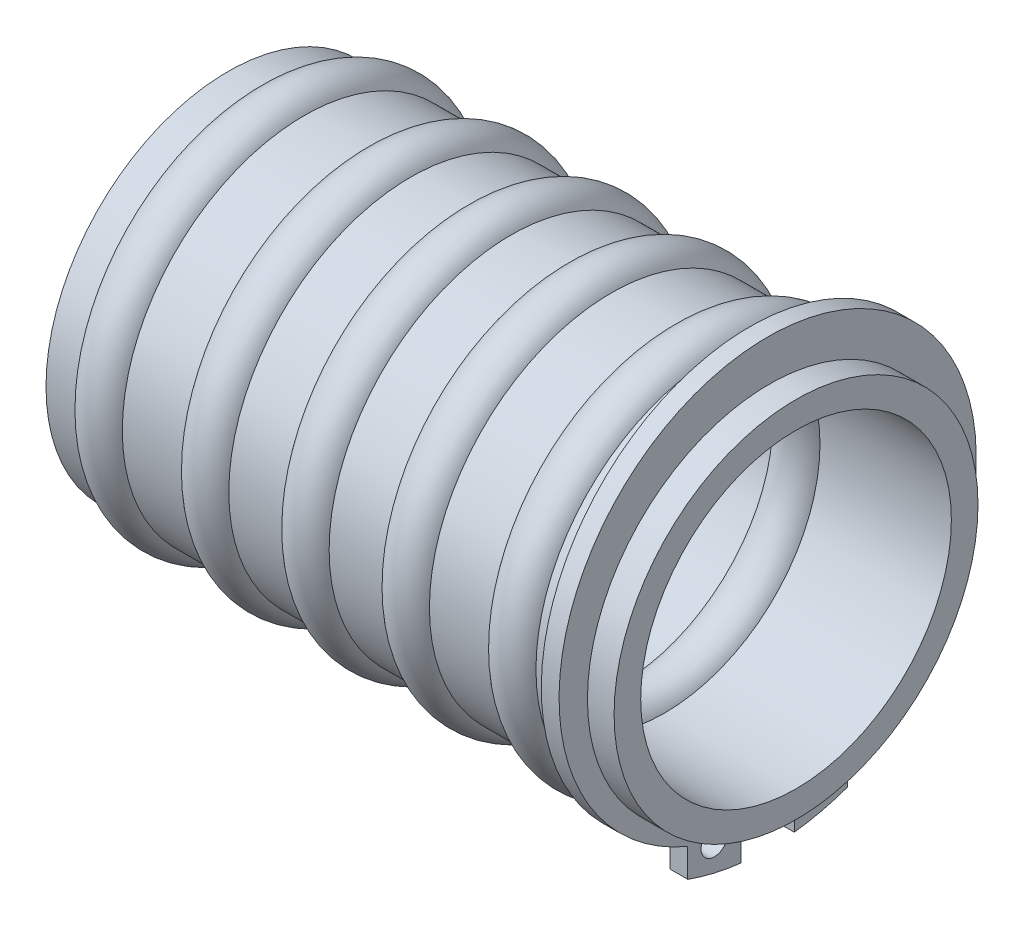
ISO-10303-21;
HEADER;
FILE_DESCRIPTION(('STEP AP214'),'2;1');
FILE_NAME('part.step','',(''),(''),'','','');
FILE_SCHEMA(('AUTOMOTIVE_DESIGN { 1 0 10303 214 1 1 1 1 }'));
ENDSEC;
DATA;
#1=APPLICATION_CONTEXT('core data for automotive mechanical design processes');
#2=APPLICATION_PROTOCOL_DEFINITION('international standard','automotive_design',2000,#1);
#3=PRODUCT_CONTEXT('',#1,'mechanical');
#4=PRODUCT('Part','Part','',(#3));
#5=PRODUCT_RELATED_PRODUCT_CATEGORY('part','',(#4));
#6=PRODUCT_DEFINITION_FORMATION('','',#4);
#7=PRODUCT_DEFINITION_CONTEXT('part definition',#1,'design');
#8=PRODUCT_DEFINITION('design','',#6,#7);
#9=PRODUCT_DEFINITION_SHAPE('','',#8);
#10=(LENGTH_UNIT() NAMED_UNIT(*) SI_UNIT(.MILLI.,.METRE.));
#11=(NAMED_UNIT(*) PLANE_ANGLE_UNIT() SI_UNIT($,.RADIAN.));
#12=(NAMED_UNIT(*) SI_UNIT($,.STERADIAN.) SOLID_ANGLE_UNIT());
#13=UNCERTAINTY_MEASURE_WITH_UNIT(LENGTH_MEASURE(1.E-05),#10,'distance_accuracy_value','');
#14=(GEOMETRIC_REPRESENTATION_CONTEXT(3) GLOBAL_UNCERTAINTY_ASSIGNED_CONTEXT((#13)) GLOBAL_UNIT_ASSIGNED_CONTEXT((#10,
#11,#12)) REPRESENTATION_CONTEXT('',''));
#15=CARTESIAN_POINT('',(0.,0.,0.));
#16=DIRECTION('',(0.,0.,1.));
#17=DIRECTION('',(1.,0.,0.));
#18=AXIS2_PLACEMENT_3D('',#15,#16,#17);
#19=CARTESIAN_POINT('',(32.,0.,0.));
#20=DIRECTION('',(-1.,0.,0.));
#21=DIRECTION('',(0.,0.,1.));
#22=AXIS2_PLACEMENT_3D('',#19,#20,#21);
#23=CYLINDRICAL_SURFACE('',#22,9.5);
#24=CARTESIAN_POINT('',(30.5,0.,0.));
#25=DIRECTION('',(-1.,0.,0.));
#26=DIRECTION('',(0.,0.,1.));
#27=AXIS2_PLACEMENT_3D('',#24,#25,#26);
#28=CIRCLE('',#27,9.5);
#29=CARTESIAN_POINT('',(30.5,0.,9.5));
#30=VERTEX_POINT('',#29);
#31=EDGE_CURVE('E203',#30,#30,#28,.T.);
#32=ORIENTED_EDGE('',*,*,#31,.T.);
#33=EDGE_LOOP('',(#32));
#34=FACE_BOUND('',#33,.T.);
#35=CARTESIAN_POINT('',(29.3,0.,0.));
#36=DIRECTION('',(-1.,0.,0.));
#37=DIRECTION('',(0.,0.,1.));
#38=AXIS2_PLACEMENT_3D('',#35,#36,#37);
#39=CIRCLE('',#38,9.5);
#40=CARTESIAN_POINT('',(29.3,0.,9.5));
#41=VERTEX_POINT('',#40);
#42=EDGE_CURVE('E200',#41,#41,#39,.T.);
#43=ORIENTED_EDGE('',*,*,#42,.F.);
#44=EDGE_LOOP('',(#43));
#45=FACE_BOUND('',#44,.T.);
#46=DIRECTION('',(-1.,0.,0.));
#47=VECTOR('',#46,1.);
#48=CARTESIAN_POINT('',(32.,-9.38083151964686,1.5));
#49=LINE('',#48,#47);
#50=CARTESIAN_POINT('',(29.4,-9.38083151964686,1.5));
#51=VERTEX_POINT('',#50);
#52=CARTESIAN_POINT('',(30.4,-9.38083151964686,1.5));
#53=VERTEX_POINT('',#52);
#54=EDGE_CURVE('E11',#51,#53,#49,.F.);
#55=ORIENTED_EDGE('',*,*,#54,.F.);
#56=CARTESIAN_POINT('',(29.4,0.,0.));
#57=DIRECTION('',(1.,0.,0.));
#58=DIRECTION('',(0.,0.,-1.));
#59=AXIS2_PLACEMENT_3D('',#56,#57,#58);
#60=CIRCLE('',#59,9.5);
#61=CARTESIAN_POINT('',(29.4,-9.38083151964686,-1.5));
#62=VERTEX_POINT('',#61);
#63=EDGE_CURVE('E237',#62,#51,#60,.T.);
#64=ORIENTED_EDGE('',*,*,#63,.F.);
#65=DIRECTION('',(-1.,0.,0.));
#66=VECTOR('',#65,1.);
#67=CARTESIAN_POINT('',(32.,-9.38083151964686,-1.5));
#68=LINE('',#67,#66);
#69=CARTESIAN_POINT('',(30.4,-9.38083151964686,-1.5));
#70=VERTEX_POINT('',#69);
#71=EDGE_CURVE('E170',#70,#62,#68,.T.);
#72=ORIENTED_EDGE('',*,*,#71,.F.);
#73=CARTESIAN_POINT('',(30.4,0.,0.));
#74=DIRECTION('',(1.,0.,0.));
#75=DIRECTION('',(0.,0.,-1.));
#76=AXIS2_PLACEMENT_3D('',#73,#74,#75);
#77=CIRCLE('',#76,9.5);
#78=EDGE_CURVE('E42',#70,#53,#77,.T.);
#79=ORIENTED_EDGE('',*,*,#78,.T.);
#80=EDGE_LOOP('',(#55,#64,#72,#79));
#81=FACE_BOUND('',#80,.T.);
#82=ADVANCED_FACE('F34',(#34,#45,#81),#23,.T.);
#83=CARTESIAN_POINT('',(32.,0.,0.));
#84=DIRECTION('',(-1.,0.,0.));
#85=DIRECTION('',(0.,0.,1.));
#86=AXIS2_PLACEMENT_3D('',#83,#84,#85);
#87=CYLINDRICAL_SURFACE('',#86,8.75);
#88=CARTESIAN_POINT('',(22.000961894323,0.,0.));
#89=DIRECTION('',(-1.,0.,0.));
#90=DIRECTION('',(0.,0.,1.));
#91=AXIS2_PLACEMENT_3D('',#88,#89,#90);
#92=CIRCLE('',#91,8.75);
#93=CARTESIAN_POINT('',(22.000961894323,0.,8.75));
#94=VERTEX_POINT('',#93);
#95=EDGE_CURVE('E218',#94,#94,#92,.T.);
#96=ORIENTED_EDGE('',*,*,#95,.F.);
#97=EDGE_LOOP('',(#96));
#98=FACE_BOUND('',#97,.T.);
#99=CARTESIAN_POINT('',(15.9490381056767,0.,0.));
#100=DIRECTION('',(-1.,0.,0.));
#101=DIRECTION('',(0.,0.,1.));
#102=AXIS2_PLACEMENT_3D('',#99,#100,#101);
#103=CIRCLE('',#102,8.75);
#104=CARTESIAN_POINT('',(15.9490381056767,0.,8.75));
#105=VERTEX_POINT('',#104);
#106=EDGE_CURVE('E163',#105,#105,#103,.F.);
#107=ORIENTED_EDGE('',*,*,#106,.F.);
#108=EDGE_LOOP('',(#107));
#109=FACE_BOUND('',#108,.T.);
#110=ADVANCED_FACE('F260',(#98,#109),#87,.F.);
#111=CARTESIAN_POINT('',(32.,0.,0.));
#112=DIRECTION('',(-1.,0.,0.));
#113=DIRECTION('',(0.,0.,1.));
#114=AXIS2_PLACEMENT_3D('',#111,#112,#113);
#115=CYLINDRICAL_SURFACE('',#114,10.25);
#116=CARTESIAN_POINT('',(19.000961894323,0.,0.));
#117=DIRECTION('',(-1.,0.,0.));
#118=DIRECTION('',(0.,0.,1.));
#119=AXIS2_PLACEMENT_3D('',#116,#117,#118);
#120=CIRCLE('',#119,10.25);
#121=CARTESIAN_POINT('',(19.000961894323,0.,10.25));
#122=VERTEX_POINT('',#121);
#123=EDGE_CURVE('E185',#122,#122,#120,.T.);
#124=ORIENTED_EDGE('',*,*,#123,.T.);
#125=EDGE_LOOP('',(#124));
#126=FACE_BOUND('',#125,.T.);
#127=CARTESIAN_POINT('',(15.9490381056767,0.,0.));
#128=DIRECTION('',(-1.,0.,0.));
#129=DIRECTION('',(0.,0.,1.));
#130=AXIS2_PLACEMENT_3D('',#127,#128,#129);
#131=CIRCLE('',#130,10.25);
#132=CARTESIAN_POINT('',(15.9490381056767,0.,10.25));
#133=VERTEX_POINT('',#132);
#134=EDGE_CURVE('E230',#133,#133,#131,.T.);
#135=ORIENTED_EDGE('',*,*,#134,.F.);
#136=EDGE_LOOP('',(#135));
#137=FACE_BOUND('',#136,.T.);
#138=ADVANCED_FACE('F266',(#126,#137),#115,.T.);
#139=CARTESIAN_POINT('',(23.3,0.,0.));
#140=DIRECTION('',(-1.,0.,0.));
#141=DIRECTION('',(0.,0.,1.));
#142=AXIS2_PLACEMENT_3D('',#139,#140,#141);
#143=TOROIDAL_SURFACE('',#142,9.50000000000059,1.50000000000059);
#144=CARTESIAN_POINT('',(24.599038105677,0.,0.));
#145=DIRECTION('',(-1.,0.,0.));
#146=DIRECTION('',(0.,0.,1.));
#147=AXIS2_PLACEMENT_3D('',#144,#145,#146);
#148=CIRCLE('',#147,8.75);
#149=CARTESIAN_POINT('',(24.599038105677,0.,8.75));
#150=VERTEX_POINT('',#149);
#151=EDGE_CURVE('E215',#150,#150,#148,.T.);
#152=ORIENTED_EDGE('',*,*,#151,.F.);
#153=EDGE_LOOP('',(#152));
#154=FACE_BOUND('',#153,.T.);
#155=ORIENTED_EDGE('',*,*,#95,.T.);
#156=EDGE_LOOP('',(#155));
#157=FACE_BOUND('',#156,.T.);
#158=ADVANCED_FACE('F290',(#154,#157),#143,.T.);
#159=CARTESIAN_POINT('',(32.,0.,0.));
#160=DIRECTION('',(-1.,0.,0.));
#161=DIRECTION('',(0.,0.,1.));
#162=AXIS2_PLACEMENT_3D('',#159,#160,#161);
#163=CYLINDRICAL_SURFACE('',#162,8.75);
#164=CARTESIAN_POINT('',(32.,0.,0.));
#165=DIRECTION('',(-1.,0.,0.));
#166=DIRECTION('',(0.,0.,1.));
#167=AXIS2_PLACEMENT_3D('',#164,#165,#166);
#168=CIRCLE('',#167,8.75);
#169=CARTESIAN_POINT('',(32.,0.,8.75));
#170=VERTEX_POINT('',#169);
#171=EDGE_CURVE('E212',#170,#170,#168,.T.);
#172=ORIENTED_EDGE('',*,*,#171,.F.);
#173=EDGE_LOOP('',(#172));
#174=FACE_BOUND('',#173,.T.);
#175=ORIENTED_EDGE('',*,*,#151,.T.);
#176=EDGE_LOOP('',(#175));
#177=FACE_BOUND('',#176,.T.);
#178=ADVANCED_FACE('F286',(#174,#177),#163,.F.);
#179=CARTESIAN_POINT('',(32.,8.75,0.));
#180=DIRECTION('',(-1.,0.,0.));
#181=DIRECTION('',(0.,0.,1.));
#182=AXIS2_PLACEMENT_3D('',#179,#180,#181);
#183=PLANE('',#182);
#184=CARTESIAN_POINT('',(32.,0.,0.));
#185=DIRECTION('',(-1.,0.,0.));
#186=DIRECTION('',(0.,0.,1.));
#187=AXIS2_PLACEMENT_3D('',#184,#185,#186);
#188=CIRCLE('',#187,10.25);
#189=CARTESIAN_POINT('',(32.,0.,10.25));
#190=VERTEX_POINT('',#189);
#191=EDGE_CURVE('E209',#190,#190,#188,.T.);
#192=ORIENTED_EDGE('',*,*,#191,.F.);
#193=EDGE_LOOP('',(#192));
#194=FACE_BOUND('',#193,.T.);
#195=ORIENTED_EDGE('',*,*,#171,.T.);
#196=EDGE_LOOP('',(#195));
#197=FACE_BOUND('',#196,.T.);
#198=ADVANCED_FACE('F282',(#194,#197),#183,.F.);
#199=CARTESIAN_POINT('',(32.,0.,0.));
#200=DIRECTION('',(-1.,0.,0.));
#201=DIRECTION('',(0.,0.,1.));
#202=AXIS2_PLACEMENT_3D('',#199,#200,#201);
#203=CYLINDRICAL_SURFACE('',#202,10.25);
#204=CARTESIAN_POINT('',(30.5,0.,0.));
#205=DIRECTION('',(-1.,0.,0.));
#206=DIRECTION('',(0.,0.,1.));
#207=AXIS2_PLACEMENT_3D('',#204,#205,#206);
#208=CIRCLE('',#207,10.25);
#209=CARTESIAN_POINT('',(30.5,0.,10.25));
#210=VERTEX_POINT('',#209);
#211=EDGE_CURVE('E206',#210,#210,#208,.T.);
#212=ORIENTED_EDGE('',*,*,#211,.F.);
#213=EDGE_LOOP('',(#212));
#214=FACE_BOUND('',#213,.T.);
#215=ORIENTED_EDGE('',*,*,#191,.T.);
#216=EDGE_LOOP('',(#215));
#217=FACE_BOUND('',#216,.T.);
#218=ADVANCED_FACE('F278',(#214,#217),#203,.T.);
#219=CARTESIAN_POINT('',(30.5,10.25,0.));
#220=DIRECTION('',(1.,0.,0.));
#221=DIRECTION('',(0.,0.,-1.));
#222=AXIS2_PLACEMENT_3D('',#219,#220,#221);
#223=PLANE('',#222);
#224=ORIENTED_EDGE('',*,*,#31,.F.);
#225=EDGE_LOOP('',(#224));
#226=FACE_BOUND('',#225,.T.);
#227=ORIENTED_EDGE('',*,*,#211,.T.);
#228=EDGE_LOOP('',(#227));
#229=FACE_BOUND('',#228,.T.);
#230=ADVANCED_FACE('F275',(#226,#229),#223,.F.);
#231=CARTESIAN_POINT('',(29.3,9.5,0.));
#232=DIRECTION('',(-1.,0.,0.));
#233=DIRECTION('',(0.,0.,1.));
#234=AXIS2_PLACEMENT_3D('',#231,#232,#233);
#235=PLANE('',#234);
#236=CARTESIAN_POINT('',(29.3,0.,0.));
#237=DIRECTION('',(-1.,0.,0.));
#238=DIRECTION('',(0.,0.,1.));
#239=AXIS2_PLACEMENT_3D('',#236,#237,#238);
#240=CIRCLE('',#239,10.25);
#241=CARTESIAN_POINT('',(29.3,0.,10.25));
#242=VERTEX_POINT('',#241);
#243=EDGE_CURVE('E197',#242,#242,#240,.T.);
#244=ORIENTED_EDGE('',*,*,#243,.F.);
#245=EDGE_LOOP('',(#244));
#246=FACE_BOUND('',#245,.T.);
#247=ORIENTED_EDGE('',*,*,#42,.T.);
#248=EDGE_LOOP('',(#247));
#249=FACE_BOUND('',#248,.T.);
#250=ADVANCED_FACE('F273',(#246,#249),#235,.F.);
#251=CARTESIAN_POINT('',(32.,0.,0.));
#252=DIRECTION('',(-1.,0.,0.));
#253=DIRECTION('',(0.,0.,1.));
#254=AXIS2_PLACEMENT_3D('',#251,#252,#253);
#255=CYLINDRICAL_SURFACE('',#254,10.25);
#256=CARTESIAN_POINT('',(27.599038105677,0.,0.));
#257=DIRECTION('',(-1.,0.,0.));
#258=DIRECTION('',(0.,0.,1.));
#259=AXIS2_PLACEMENT_3D('',#256,#257,#258);
#260=CIRCLE('',#259,10.25);
#261=CARTESIAN_POINT('',(27.599038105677,0.,10.25));
#262=VERTEX_POINT('',#261);
#263=EDGE_CURVE('E194',#262,#262,#260,.T.);
#264=ORIENTED_EDGE('',*,*,#263,.F.);
#265=EDGE_LOOP('',(#264));
#266=FACE_BOUND('',#265,.T.);
#267=ORIENTED_EDGE('',*,*,#243,.T.);
#268=EDGE_LOOP('',(#267));
#269=FACE_BOUND('',#268,.T.);
#270=ADVANCED_FACE('F492',(#266,#269),#255,.T.);
#271=CARTESIAN_POINT('',(26.3,0.,0.));
#272=DIRECTION('',(-1.,0.,0.));
#273=DIRECTION('',(0.,0.,1.));
#274=AXIS2_PLACEMENT_3D('',#271,#272,#273);
#275=TOROIDAL_SURFACE('',#274,9.4999999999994,1.5000000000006);
#276=CARTESIAN_POINT('',(25.000961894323,0.,0.));
#277=DIRECTION('',(-1.,0.,0.));
#278=DIRECTION('',(0.,0.,1.));
#279=AXIS2_PLACEMENT_3D('',#276,#277,#278);
#280=CIRCLE('',#279,10.25);
#281=CARTESIAN_POINT('',(25.000961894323,0.,10.25));
#282=VERTEX_POINT('',#281);
#283=EDGE_CURVE('E191',#282,#282,#280,.T.);
#284=ORIENTED_EDGE('',*,*,#283,.F.);
#285=EDGE_LOOP('',(#284));
#286=FACE_BOUND('',#285,.T.);
#287=ORIENTED_EDGE('',*,*,#263,.T.);
#288=EDGE_LOOP('',(#287));
#289=FACE_BOUND('',#288,.T.);
#290=ADVANCED_FACE('F501',(#286,#289),#275,.T.);
#291=CARTESIAN_POINT('',(32.,0.,0.));
#292=DIRECTION('',(-1.,0.,0.));
#293=DIRECTION('',(0.,0.,1.));
#294=AXIS2_PLACEMENT_3D('',#291,#292,#293);
#295=CYLINDRICAL_SURFACE('',#294,10.25);
#296=CARTESIAN_POINT('',(21.599038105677,0.,0.));
#297=DIRECTION('',(-1.,0.,0.));
#298=DIRECTION('',(0.,0.,1.));
#299=AXIS2_PLACEMENT_3D('',#296,#297,#298);
#300=CIRCLE('',#299,10.25);
#301=CARTESIAN_POINT('',(21.599038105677,0.,10.25));
#302=VERTEX_POINT('',#301);
#303=EDGE_CURVE('E188',#302,#302,#300,.T.);
#304=ORIENTED_EDGE('',*,*,#303,.F.);
#305=EDGE_LOOP('',(#304));
#306=FACE_BOUND('',#305,.T.);
#307=ORIENTED_EDGE('',*,*,#283,.T.);
#308=EDGE_LOOP('',(#307));
#309=FACE_BOUND('',#308,.T.);
#310=ADVANCED_FACE('F352',(#306,#309),#295,.T.);
#311=CARTESIAN_POINT('',(20.3,0.,0.));
#312=DIRECTION('',(-1.,0.,0.));
#313=DIRECTION('',(0.,0.,1.));
#314=AXIS2_PLACEMENT_3D('',#311,#312,#313);
#315=TOROIDAL_SURFACE('',#314,9.49999999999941,1.50000000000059);
#316=ORIENTED_EDGE('',*,*,#123,.F.);
#317=EDGE_LOOP('',(#316));
#318=FACE_BOUND('',#317,.T.);
#319=ORIENTED_EDGE('',*,*,#303,.T.);
#320=EDGE_LOOP('',(#319));
#321=FACE_BOUND('',#320,.T.);
#322=ADVANCED_FACE('F346',(#318,#321),#315,.T.);
#323=CARTESIAN_POINT('',(14.65,0.,0.));
#324=DIRECTION('',(-1.,0.,0.));
#325=DIRECTION('',(0.,0.,1.));
#326=AXIS2_PLACEMENT_3D('',#323,#324,#325);
#327=TOROIDAL_SURFACE('',#326,9.5,1.5);
#328=ORIENTED_EDGE('',*,*,#134,.T.);
#329=EDGE_LOOP('',(#328));
#330=FACE_BOUND('',#329,.T.);
#331=CARTESIAN_POINT('',(13.3509618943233,0.,0.));
#332=DIRECTION('',(1.,0.,0.));
#333=DIRECTION('',(0.,0.,-1.));
#334=AXIS2_PLACEMENT_3D('',#331,#332,#333);
#335=CIRCLE('',#334,10.25);
#336=CARTESIAN_POINT('',(13.3509618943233,0.,-10.25));
#337=VERTEX_POINT('',#336);
#338=EDGE_CURVE('E167',#337,#337,#335,.T.);
#339=ORIENTED_EDGE('',*,*,#338,.T.);
#340=EDGE_LOOP('',(#339));
#341=FACE_BOUND('',#340,.T.);
#342=ADVANCED_FACE('F307',(#330,#341),#327,.T.);
#343=CARTESIAN_POINT('',(0.,10.25,0.));
#344=DIRECTION('',(1.,0.,0.));
#345=DIRECTION('',(0.,0.,-1.));
#346=AXIS2_PLACEMENT_3D('',#343,#344,#345);
#347=PLANE('',#346);
#348=CARTESIAN_POINT('',(0.,0.,0.));
#349=DIRECTION('',(-1.,0.,0.));
#350=DIRECTION('',(0.,0.,1.));
#351=AXIS2_PLACEMENT_3D('',#348,#349,#350);
#352=CIRCLE('',#351,8.75);
#353=CARTESIAN_POINT('',(0.,0.,8.75));
#354=VERTEX_POINT('',#353);
#355=EDGE_CURVE('E227',#354,#354,#352,.T.);
#356=ORIENTED_EDGE('',*,*,#355,.F.);
#357=EDGE_LOOP('',(#356));
#358=FACE_BOUND('',#357,.T.);
#359=CARTESIAN_POINT('',(0.,0.,0.));
#360=DIRECTION('',(-1.,0.,0.));
#361=DIRECTION('',(0.,0.,1.));
#362=AXIS2_PLACEMENT_3D('',#359,#360,#361);
#363=CIRCLE('',#362,10.25);
#364=CARTESIAN_POINT('',(0.,0.,10.25));
#365=VERTEX_POINT('',#364);
#366=EDGE_CURVE('E114',#365,#365,#363,.T.);
#367=ORIENTED_EDGE('',*,*,#366,.T.);
#368=EDGE_LOOP('',(#367));
#369=FACE_BOUND('',#368,.T.);
#370=ADVANCED_FACE('F36',(#358,#369),#347,.F.);
#371=CARTESIAN_POINT('',(32.,0.,0.));
#372=DIRECTION('',(-1.,0.,0.));
#373=DIRECTION('',(0.,0.,1.));
#374=AXIS2_PLACEMENT_3D('',#371,#372,#373);
#375=CYLINDRICAL_SURFACE('',#374,8.75);
#376=CARTESIAN_POINT('',(4.7009618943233,0.,0.));
#377=DIRECTION('',(-1.,0.,0.));
#378=DIRECTION('',(0.,0.,1.));
#379=AXIS2_PLACEMENT_3D('',#376,#377,#378);
#380=CIRCLE('',#379,8.75);
#381=CARTESIAN_POINT('',(4.7009618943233,0.,8.75));
#382=VERTEX_POINT('',#381);
#383=EDGE_CURVE('E224',#382,#382,#380,.T.);
#384=ORIENTED_EDGE('',*,*,#383,.F.);
#385=EDGE_LOOP('',(#384));
#386=FACE_BOUND('',#385,.T.);
#387=ORIENTED_EDGE('',*,*,#355,.T.);
#388=EDGE_LOOP('',(#387));
#389=FACE_BOUND('',#388,.T.);
#390=ADVANCED_FACE('F300',(#386,#389),#375,.F.);
#391=CARTESIAN_POINT('',(6.,0.,0.));
#392=DIRECTION('',(-1.,0.,0.));
#393=DIRECTION('',(0.,0.,1.));
#394=AXIS2_PLACEMENT_3D('',#391,#392,#393);
#395=TOROIDAL_SURFACE('',#394,9.50000000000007,1.50000000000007);
#396=CARTESIAN_POINT('',(7.2990381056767,0.,0.));
#397=DIRECTION('',(-1.,0.,0.));
#398=DIRECTION('',(0.,0.,1.));
#399=AXIS2_PLACEMENT_3D('',#396,#397,#398);
#400=CIRCLE('',#399,8.75);
#401=CARTESIAN_POINT('',(7.2990381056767,0.,8.75));
#402=VERTEX_POINT('',#401);
#403=EDGE_CURVE('E221',#402,#402,#400,.T.);
#404=ORIENTED_EDGE('',*,*,#403,.F.);
#405=EDGE_LOOP('',(#404));
#406=FACE_BOUND('',#405,.T.);
#407=ORIENTED_EDGE('',*,*,#383,.T.);
#408=EDGE_LOOP('',(#407));
#409=FACE_BOUND('',#408,.T.);
#410=ADVANCED_FACE('F297',(#406,#409),#395,.T.);
#411=ORIENTED_EDGE('',*,*,#403,.T.);
#412=EDGE_LOOP('',(#411));
#413=FACE_BOUND('',#412,.T.);
#414=CARTESIAN_POINT('',(13.3509618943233,0.,0.));
#415=DIRECTION('',(1.,0.,0.));
#416=DIRECTION('',(0.,0.,-1.));
#417=AXIS2_PLACEMENT_3D('',#414,#415,#416);
#418=CIRCLE('',#417,8.75);
#419=CARTESIAN_POINT('',(13.3509618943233,0.,-8.75));
#420=VERTEX_POINT('',#419);
#421=EDGE_CURVE('E166',#420,#420,#418,.F.);
#422=ORIENTED_EDGE('',*,*,#421,.F.);
#423=EDGE_LOOP('',(#422));
#424=FACE_BOUND('',#423,.T.);
#425=ADVANCED_FACE('F269',(#413,#424),#87,.F.);
#426=CARTESIAN_POINT('',(32.,0.,0.));
#427=DIRECTION('',(-1.,0.,0.));
#428=DIRECTION('',(0.,0.,1.));
#429=AXIS2_PLACEMENT_3D('',#426,#427,#428);
#430=CYLINDRICAL_SURFACE('',#429,10.25);
#431=ORIENTED_EDGE('',*,*,#366,.F.);
#432=EDGE_LOOP('',(#431));
#433=FACE_BOUND('',#432,.T.);
#434=CARTESIAN_POINT('',(1.7009618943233,0.,0.));
#435=DIRECTION('',(-1.,0.,0.));
#436=DIRECTION('',(0.,0.,1.));
#437=AXIS2_PLACEMENT_3D('',#434,#435,#436);
#438=CIRCLE('',#437,10.25);
#439=CARTESIAN_POINT('',(1.7009618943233,0.,10.25));
#440=VERTEX_POINT('',#439);
#441=EDGE_CURVE('E173',#440,#440,#438,.T.);
#442=ORIENTED_EDGE('',*,*,#441,.T.);
#443=EDGE_LOOP('',(#442));
#444=FACE_BOUND('',#443,.T.);
#445=ADVANCED_FACE('F296',(#433,#444),#430,.T.);
#446=CARTESIAN_POINT('',(3.,0.,0.));
#447=DIRECTION('',(-1.,0.,0.));
#448=DIRECTION('',(0.,0.,1.));
#449=AXIS2_PLACEMENT_3D('',#446,#447,#448);
#450=TOROIDAL_SURFACE('',#449,9.49999999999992,1.50000000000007);
#451=ORIENTED_EDGE('',*,*,#441,.F.);
#452=EDGE_LOOP('',(#451));
#453=FACE_BOUND('',#452,.T.);
#454=CARTESIAN_POINT('',(4.2990381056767,0.,0.));
#455=DIRECTION('',(-1.,0.,0.));
#456=DIRECTION('',(0.,0.,1.));
#457=AXIS2_PLACEMENT_3D('',#454,#455,#456);
#458=CIRCLE('',#457,10.25);
#459=CARTESIAN_POINT('',(4.2990381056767,0.,10.25));
#460=VERTEX_POINT('',#459);
#461=EDGE_CURVE('E176',#460,#460,#458,.T.);
#462=ORIENTED_EDGE('',*,*,#461,.T.);
#463=EDGE_LOOP('',(#462));
#464=FACE_BOUND('',#463,.T.);
#465=ADVANCED_FACE('F317',(#453,#464),#450,.T.);
#466=CARTESIAN_POINT('',(32.,0.,0.));
#467=DIRECTION('',(-1.,0.,0.));
#468=DIRECTION('',(0.,0.,1.));
#469=AXIS2_PLACEMENT_3D('',#466,#467,#468);
#470=CYLINDRICAL_SURFACE('',#469,10.25);
#471=ORIENTED_EDGE('',*,*,#461,.F.);
#472=EDGE_LOOP('',(#471));
#473=FACE_BOUND('',#472,.T.);
#474=CARTESIAN_POINT('',(7.7009618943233,0.,0.));
#475=DIRECTION('',(-1.,0.,0.));
#476=DIRECTION('',(0.,0.,1.));
#477=AXIS2_PLACEMENT_3D('',#474,#475,#476);
#478=CIRCLE('',#477,10.25);
#479=CARTESIAN_POINT('',(7.7009618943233,0.,10.25));
#480=VERTEX_POINT('',#479);
#481=EDGE_CURVE('E179',#480,#480,#478,.T.);
#482=ORIENTED_EDGE('',*,*,#481,.T.);
#483=EDGE_LOOP('',(#482));
#484=FACE_BOUND('',#483,.T.);
#485=ADVANCED_FACE('F323',(#473,#484),#470,.T.);
#486=CARTESIAN_POINT('',(9.00000000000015,0.,0.));
#487=DIRECTION('',(-1.,0.,0.));
#488=DIRECTION('',(0.,0.,1.));
#489=AXIS2_PLACEMENT_3D('',#486,#487,#488);
#490=TOROIDAL_SURFACE('',#489,9.49999999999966,1.50000000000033);
#491=ORIENTED_EDGE('',*,*,#481,.F.);
#492=EDGE_LOOP('',(#491));
#493=FACE_BOUND('',#492,.T.);
#494=CARTESIAN_POINT('',(10.299038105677,0.,0.));
#495=DIRECTION('',(-1.,0.,0.));
#496=DIRECTION('',(0.,0.,1.));
#497=AXIS2_PLACEMENT_3D('',#494,#495,#496);
#498=CIRCLE('',#497,10.25);
#499=CARTESIAN_POINT('',(10.299038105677,0.,10.25));
#500=VERTEX_POINT('',#499);
#501=EDGE_CURVE('E182',#500,#500,#498,.T.);
#502=ORIENTED_EDGE('',*,*,#501,.T.);
#503=EDGE_LOOP('',(#502));
#504=FACE_BOUND('',#503,.T.);
#505=ADVANCED_FACE('F329',(#493,#504),#490,.T.);
#506=ORIENTED_EDGE('',*,*,#501,.F.);
#507=EDGE_LOOP('',(#506));
#508=FACE_BOUND('',#507,.T.);
#509=ORIENTED_EDGE('',*,*,#338,.F.);
#510=EDGE_LOOP('',(#509));
#511=FACE_BOUND('',#510,.T.);
#512=ADVANCED_FACE('F335',(#508,#511),#115,.T.);
#513=ORIENTED_EDGE('',*,*,#106,.T.);
#514=EDGE_LOOP('',(#513));
#515=FACE_BOUND('',#514,.T.);
#516=ORIENTED_EDGE('',*,*,#421,.T.);
#517=EDGE_LOOP('',(#516));
#518=FACE_BOUND('',#517,.T.);
#519=ADVANCED_FACE('F341',(#515,#518),#327,.T.);
#520=CARTESIAN_POINT('',(30.4,0.750000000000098,0.));
#521=DIRECTION('',(1.,0.,0.));
#522=DIRECTION('',(0.,0.,-1.));
#523=AXIS2_PLACEMENT_3D('',#520,#521,#522);
#524=PLANE('',#523);
#525=CARTESIAN_POINT('',(30.4,-10.610567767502,3.));
#526=DIRECTION('',(1.,0.,0.));
#527=DIRECTION('',(0.,0.,-1.));
#528=AXIS2_PLACEMENT_3D('',#525,#526,#527);
#529=CIRCLE('',#528,0.75);
#530=CARTESIAN_POINT('',(30.4,-10.610567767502,2.25));
#531=VERTEX_POINT('',#530);
#532=EDGE_CURVE('E695',#531,#531,#529,.T.);
#533=ORIENTED_EDGE('',*,*,#532,.F.);
#534=EDGE_LOOP('',(#533));
#535=FACE_BOUND('',#534,.T.);
#536=CARTESIAN_POINT('',(30.4,-10.610567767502,-3.));
#537=DIRECTION('',(1.,0.,0.));
#538=DIRECTION('',(0.,0.,-1.));
#539=AXIS2_PLACEMENT_3D('',#536,#537,#538);
#540=CIRCLE('',#539,0.75);
#541=CARTESIAN_POINT('',(30.4,-10.610567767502,-3.75));
#542=VERTEX_POINT('',#541);
#543=EDGE_CURVE('E121',#542,#542,#540,.T.);
#544=ORIENTED_EDGE('',*,*,#543,.F.);
#545=EDGE_LOOP('',(#544));
#546=FACE_BOUND('',#545,.T.);
#547=ORIENTED_EDGE('',*,*,#78,.F.);
#548=DIRECTION('',(0.,-1.,0.));
#549=VECTOR('',#548,1.);
#550=CARTESIAN_POINT('',(30.4,-9.178235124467,-1.5));
#551=LINE('',#550,#549);
#552=CARTESIAN_POINT('',(30.4,-12.414820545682,-1.49999999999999));
#553=VERTEX_POINT('',#552);
#554=EDGE_CURVE('E146',#70,#553,#551,.T.);
#555=ORIENTED_EDGE('',*,*,#554,.T.);
#556=CARTESIAN_POINT('',(30.4,0.750000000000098,0.));
#557=DIRECTION('',(1.,0.,0.));
#558=DIRECTION('',(0.,0.,-1.));
#559=AXIS2_PLACEMENT_3D('',#556,#557,#558);
#560=CIRCLE('',#559,13.2500000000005);
#561=CARTESIAN_POINT('',(30.4,-11.712443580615,-4.5));
#562=VERTEX_POINT('',#561);
#563=EDGE_CURVE('E148',#553,#562,#560,.T.);
#564=ORIENTED_EDGE('',*,*,#563,.T.);
#565=DIRECTION('',(0.,1.,0.));
#566=VECTOR('',#565,1.);
#567=CARTESIAN_POINT('',(30.4,-11.712443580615,-4.5));
#568=LINE('',#567,#566);
#569=CARTESIAN_POINT('',(30.4,-10.104146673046,-4.5));
#570=VERTEX_POINT('',#569);
#571=EDGE_CURVE('E150',#562,#570,#568,.T.);
#572=ORIENTED_EDGE('',*,*,#571,.T.);
#573=CARTESIAN_POINT('',(30.4,0.750000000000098,0.));
#574=DIRECTION('',(1.,0.,0.));
#575=DIRECTION('',(0.,0.,-1.));
#576=AXIS2_PLACEMENT_3D('',#573,#574,#575);
#577=CIRCLE('',#576,11.7499999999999);
#578=CARTESIAN_POINT('',(30.4,-10.104146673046,4.5));
#579=VERTEX_POINT('',#578);
#580=EDGE_CURVE('E138',#570,#579,#577,.T.);
#581=ORIENTED_EDGE('',*,*,#580,.T.);
#582=DIRECTION('',(0.,-1.,0.));
#583=VECTOR('',#582,1.);
#584=CARTESIAN_POINT('',(30.4,-10.104146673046,4.5));
#585=LINE('',#584,#583);
#586=CARTESIAN_POINT('',(30.4,-11.712443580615,4.5));
#587=VERTEX_POINT('',#586);
#588=EDGE_CURVE('E110',#579,#587,#585,.T.);
#589=ORIENTED_EDGE('',*,*,#588,.T.);
#590=CARTESIAN_POINT('',(30.4,0.750000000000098,0.));
#591=DIRECTION('',(1.,0.,0.));
#592=DIRECTION('',(0.,0.,-1.));
#593=AXIS2_PLACEMENT_3D('',#590,#591,#592);
#594=CIRCLE('',#593,13.2500000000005);
#595=CARTESIAN_POINT('',(30.4,-12.414820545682,1.5));
#596=VERTEX_POINT('',#595);
#597=EDGE_CURVE('E141',#587,#596,#594,.T.);
#598=ORIENTED_EDGE('',*,*,#597,.T.);
#599=DIRECTION('',(0.,1.,0.));
#600=VECTOR('',#599,1.);
#601=CARTESIAN_POINT('',(30.4,-12.414820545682,1.5));
#602=LINE('',#601,#600);
#603=EDGE_CURVE('E143',#596,#53,#602,.T.);
#604=ORIENTED_EDGE('',*,*,#603,.T.);
#605=EDGE_LOOP('',(#547,#555,#564,#572,#581,#589,#598,#604));
#606=FACE_BOUND('',#605,.T.);
#607=ADVANCED_FACE('F247',(#535,#546,#606),#524,.T.);
#608=CARTESIAN_POINT('',(29.4,0.750000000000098,0.));
#609=DIRECTION('',(1.,0.,0.));
#610=DIRECTION('',(0.,0.,-1.));
#611=AXIS2_PLACEMENT_3D('',#608,#609,#610);
#612=PLANE('',#611);
#613=CARTESIAN_POINT('',(29.4,-10.610567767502,3.));
#614=DIRECTION('',(1.,0.,0.));
#615=DIRECTION('',(0.,0.,-1.));
#616=AXIS2_PLACEMENT_3D('',#613,#614,#615);
#617=CIRCLE('',#616,0.75);
#618=CARTESIAN_POINT('',(29.4,-10.610567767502,2.25));
#619=VERTEX_POINT('',#618);
#620=EDGE_CURVE('E698',#619,#619,#617,.T.);
#621=ORIENTED_EDGE('',*,*,#620,.T.);
#622=EDGE_LOOP('',(#621));
#623=FACE_BOUND('',#622,.T.);
#624=CARTESIAN_POINT('',(29.4,-10.610567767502,-3.));
#625=DIRECTION('',(1.,0.,0.));
#626=DIRECTION('',(0.,0.,-1.));
#627=AXIS2_PLACEMENT_3D('',#624,#625,#626);
#628=CIRCLE('',#627,0.75);
#629=CARTESIAN_POINT('',(29.4,-10.610567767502,-3.75));
#630=VERTEX_POINT('',#629);
#631=EDGE_CURVE('E124',#630,#630,#628,.T.);
#632=ORIENTED_EDGE('',*,*,#631,.T.);
#633=EDGE_LOOP('',(#632));
#634=FACE_BOUND('',#633,.T.);
#635=DIRECTION('',(0.,-1.,0.));
#636=VECTOR('',#635,1.);
#637=CARTESIAN_POINT('',(29.4,-9.178235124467,-1.5));
#638=LINE('',#637,#636);
#639=CARTESIAN_POINT('',(29.4,-12.414820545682,-1.49999999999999));
#640=VERTEX_POINT('',#639);
#641=EDGE_CURVE('E132',#62,#640,#638,.T.);
#642=ORIENTED_EDGE('',*,*,#641,.F.);
#643=ORIENTED_EDGE('',*,*,#63,.T.);
#644=DIRECTION('',(0.,1.,0.));
#645=VECTOR('',#644,1.);
#646=CARTESIAN_POINT('',(29.4,-12.414820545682,1.5));
#647=LINE('',#646,#645);
#648=CARTESIAN_POINT('',(29.4,-12.414820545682,1.5));
#649=VERTEX_POINT('',#648);
#650=EDGE_CURVE('E129',#649,#51,#647,.T.);
#651=ORIENTED_EDGE('',*,*,#650,.F.);
#652=CARTESIAN_POINT('',(29.4,0.750000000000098,0.));
#653=DIRECTION('',(1.,0.,0.));
#654=DIRECTION('',(0.,0.,-1.));
#655=AXIS2_PLACEMENT_3D('',#652,#653,#654);
#656=CIRCLE('',#655,13.2500000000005);
#657=CARTESIAN_POINT('',(29.4,-11.712443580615,4.5));
#658=VERTEX_POINT('',#657);
#659=EDGE_CURVE('E102',#658,#649,#656,.T.);
#660=ORIENTED_EDGE('',*,*,#659,.F.);
#661=DIRECTION('',(0.,-1.,0.));
#662=VECTOR('',#661,1.);
#663=CARTESIAN_POINT('',(29.4,-10.104146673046,4.5));
#664=LINE('',#663,#662);
#665=CARTESIAN_POINT('',(29.4,-10.104146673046,4.5));
#666=VERTEX_POINT('',#665);
#667=EDGE_CURVE('E94',#666,#658,#664,.T.);
#668=ORIENTED_EDGE('',*,*,#667,.F.);
#669=CARTESIAN_POINT('',(29.4,0.750000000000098,0.));
#670=DIRECTION('',(1.,0.,0.));
#671=DIRECTION('',(0.,0.,-1.));
#672=AXIS2_PLACEMENT_3D('',#669,#670,#671);
#673=CIRCLE('',#672,11.7499999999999);
#674=CARTESIAN_POINT('',(29.4,-10.104146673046,-4.5));
#675=VERTEX_POINT('',#674);
#676=EDGE_CURVE('E100',#675,#666,#673,.T.);
#677=ORIENTED_EDGE('',*,*,#676,.F.);
#678=DIRECTION('',(0.,1.,0.));
#679=VECTOR('',#678,1.);
#680=CARTESIAN_POINT('',(29.4,-11.712443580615,-4.5));
#681=LINE('',#680,#679);
#682=CARTESIAN_POINT('',(29.4,-11.712443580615,-4.5));
#683=VERTEX_POINT('',#682);
#684=EDGE_CURVE('E136',#683,#675,#681,.T.);
#685=ORIENTED_EDGE('',*,*,#684,.F.);
#686=CARTESIAN_POINT('',(29.4,0.750000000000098,0.));
#687=DIRECTION('',(1.,0.,0.));
#688=DIRECTION('',(0.,0.,-1.));
#689=AXIS2_PLACEMENT_3D('',#686,#687,#688);
#690=CIRCLE('',#689,13.2500000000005);
#691=EDGE_CURVE('E134',#640,#683,#690,.T.);
#692=ORIENTED_EDGE('',*,*,#691,.F.);
#693=EDGE_LOOP('',(#642,#643,#651,#660,#668,#677,#685,#692));
#694=FACE_BOUND('',#693,.T.);
#695=ADVANCED_FACE('F97',(#623,#634,#694),#612,.F.);
#696=CARTESIAN_POINT('',(30.4,-12.414820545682,1.5));
#697=DIRECTION('',(0.,0.,1.));
#698=DIRECTION('',(1.,0.,0.));
#699=AXIS2_PLACEMENT_3D('',#696,#697,#698);
#700=PLANE('',#699);
#701=ORIENTED_EDGE('',*,*,#650,.T.);
#702=ORIENTED_EDGE('',*,*,#54,.T.);
#703=ORIENTED_EDGE('',*,*,#603,.F.);
#704=DIRECTION('',(-1.,0.,0.));
#705=VECTOR('',#704,1.);
#706=CARTESIAN_POINT('',(30.4,-12.414820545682,1.5));
#707=LINE('',#706,#705);
#708=EDGE_CURVE('E159',#596,#649,#707,.T.);
#709=ORIENTED_EDGE('',*,*,#708,.T.);
#710=EDGE_LOOP('',(#701,#702,#703,#709));
#711=FACE_BOUND('',#710,.T.);
#712=ADVANCED_FACE('F240',(#711),#700,.F.);
#713=CARTESIAN_POINT('',(30.4,-9.178235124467,-1.5));
#714=DIRECTION('',(0.,0.,-1.));
#715=DIRECTION('',(-1.,0.,0.));
#716=AXIS2_PLACEMENT_3D('',#713,#714,#715);
#717=PLANE('',#716);
#718=ORIENTED_EDGE('',*,*,#554,.F.);
#719=ORIENTED_EDGE('',*,*,#71,.T.);
#720=ORIENTED_EDGE('',*,*,#641,.T.);
#721=DIRECTION('',(-1.,0.,0.));
#722=VECTOR('',#721,1.);
#723=CARTESIAN_POINT('',(30.4,-12.414820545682,-1.49999999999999));
#724=LINE('',#723,#722);
#725=EDGE_CURVE('E156',#553,#640,#724,.T.);
#726=ORIENTED_EDGE('',*,*,#725,.F.);
#727=EDGE_LOOP('',(#718,#719,#720,#726));
#728=FACE_BOUND('',#727,.T.);
#729=ADVANCED_FACE('F258',(#728),#717,.F.);
#730=CARTESIAN_POINT('',(30.4,0.750000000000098,0.));
#731=DIRECTION('',(-1.,0.,0.));
#732=DIRECTION('',(0.,0.,1.));
#733=AXIS2_PLACEMENT_3D('',#730,#731,#732);
#734=CYLINDRICAL_SURFACE('',#733,11.7499999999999);
#735=ORIENTED_EDGE('',*,*,#676,.T.);
#736=DIRECTION('',(-1.,0.,0.));
#737=VECTOR('',#736,1.);
#738=CARTESIAN_POINT('',(30.4,-10.104146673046,4.5));
#739=LINE('',#738,#737);
#740=EDGE_CURVE('E108',#579,#666,#739,.T.);
#741=ORIENTED_EDGE('',*,*,#740,.F.);
#742=ORIENTED_EDGE('',*,*,#580,.F.);
#743=DIRECTION('',(-1.,0.,0.));
#744=VECTOR('',#743,1.);
#745=CARTESIAN_POINT('',(30.4,-10.104146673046,-4.5));
#746=LINE('',#745,#744);
#747=EDGE_CURVE('E120',#570,#675,#746,.T.);
#748=ORIENTED_EDGE('',*,*,#747,.T.);
#749=EDGE_LOOP('',(#735,#741,#742,#748));
#750=FACE_BOUND('',#749,.T.);
#751=ADVANCED_FACE('F118',(#750),#734,.T.);
#752=CARTESIAN_POINT('',(30.4,-10.104146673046,4.5));
#753=DIRECTION('',(0.,0.,-1.));
#754=DIRECTION('',(-1.,0.,0.));
#755=AXIS2_PLACEMENT_3D('',#752,#753,#754);
#756=PLANE('',#755);
#757=ORIENTED_EDGE('',*,*,#667,.T.);
#758=DIRECTION('',(-1.,0.,0.));
#759=VECTOR('',#758,1.);
#760=CARTESIAN_POINT('',(30.4,-11.712443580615,4.5));
#761=LINE('',#760,#759);
#762=EDGE_CURVE('E115',#587,#658,#761,.T.);
#763=ORIENTED_EDGE('',*,*,#762,.F.);
#764=ORIENTED_EDGE('',*,*,#588,.F.);
#765=ORIENTED_EDGE('',*,*,#740,.T.);
#766=EDGE_LOOP('',(#757,#763,#764,#765));
#767=FACE_BOUND('',#766,.T.);
#768=ADVANCED_FACE('F109',(#767),#756,.F.);
#769=CARTESIAN_POINT('',(30.4,0.750000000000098,0.));
#770=DIRECTION('',(-1.,0.,0.));
#771=DIRECTION('',(0.,0.,1.));
#772=AXIS2_PLACEMENT_3D('',#769,#770,#771);
#773=CYLINDRICAL_SURFACE('',#772,13.2500000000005);
#774=ORIENTED_EDGE('',*,*,#659,.T.);
#775=ORIENTED_EDGE('',*,*,#708,.F.);
#776=ORIENTED_EDGE('',*,*,#597,.F.);
#777=ORIENTED_EDGE('',*,*,#762,.T.);
#778=EDGE_LOOP('',(#774,#775,#776,#777));
#779=FACE_BOUND('',#778,.T.);
#780=ADVANCED_FACE('F245',(#779),#773,.T.);
#781=CARTESIAN_POINT('',(30.4,0.750000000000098,0.));
#782=DIRECTION('',(-1.,0.,0.));
#783=DIRECTION('',(0.,0.,1.));
#784=AXIS2_PLACEMENT_3D('',#781,#782,#783);
#785=CYLINDRICAL_SURFACE('',#784,13.2500000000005);
#786=ORIENTED_EDGE('',*,*,#691,.T.);
#787=DIRECTION('',(-1.,0.,0.));
#788=VECTOR('',#787,1.);
#789=CARTESIAN_POINT('',(30.4,-11.712443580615,-4.5));
#790=LINE('',#789,#788);
#791=EDGE_CURVE('E153',#562,#683,#790,.T.);
#792=ORIENTED_EDGE('',*,*,#791,.F.);
#793=ORIENTED_EDGE('',*,*,#563,.F.);
#794=ORIENTED_EDGE('',*,*,#725,.T.);
#795=EDGE_LOOP('',(#786,#792,#793,#794));
#796=FACE_BOUND('',#795,.T.);
#797=ADVANCED_FACE('F254',(#796),#785,.T.);
#798=CARTESIAN_POINT('',(30.4,-11.712443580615,-4.5));
#799=DIRECTION('',(0.,0.,1.));
#800=DIRECTION('',(1.,0.,0.));
#801=AXIS2_PLACEMENT_3D('',#798,#799,#800);
#802=PLANE('',#801);
#803=ORIENTED_EDGE('',*,*,#684,.T.);
#804=ORIENTED_EDGE('',*,*,#747,.F.);
#805=ORIENTED_EDGE('',*,*,#571,.F.);
#806=ORIENTED_EDGE('',*,*,#791,.T.);
#807=EDGE_LOOP('',(#803,#804,#805,#806));
#808=FACE_BOUND('',#807,.T.);
#809=ADVANCED_FACE('F252',(#808),#802,.F.);
#810=CARTESIAN_POINT('',(30.4,-10.610567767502,-3.));
#811=DIRECTION('',(-1.,0.,0.));
#812=DIRECTION('',(0.,0.,1.));
#813=AXIS2_PLACEMENT_3D('',#810,#811,#812);
#814=CYLINDRICAL_SURFACE('',#813,0.75);
#815=ORIENTED_EDGE('',*,*,#543,.T.);
#816=EDGE_LOOP('',(#815));
#817=FACE_BOUND('',#816,.T.);
#818=ORIENTED_EDGE('',*,*,#631,.F.);
#819=EDGE_LOOP('',(#818));
#820=FACE_BOUND('',#819,.T.);
#821=ADVANCED_FACE('F379',(#817,#820),#814,.F.);
#822=CARTESIAN_POINT('',(30.4,-10.610567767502,3.));
#823=DIRECTION('',(-1.,0.,0.));
#824=DIRECTION('',(0.,0.,1.));
#825=AXIS2_PLACEMENT_3D('',#822,#823,#824);
#826=CYLINDRICAL_SURFACE('',#825,0.75);
#827=ORIENTED_EDGE('',*,*,#532,.T.);
#828=EDGE_LOOP('',(#827));
#829=FACE_BOUND('',#828,.T.);
#830=ORIENTED_EDGE('',*,*,#620,.F.);
#831=EDGE_LOOP('',(#830));
#832=FACE_BOUND('',#831,.T.);
#833=ADVANCED_FACE('F416',(#829,#832),#826,.F.);
#834=CLOSED_SHELL('',(#82,#110,#138,#158,#178,#198,#218,#230,#250,#270,#290,#310,#322,#342,#370,
#390,#410,#425,#445,#465,#485,#505,#512,#519,#607,#695,#712,#729,#751,#768,#780,#797,#809,#821,#833));
#835=MANIFOLD_SOLID_BREP('B2',#834);
#836=ADVANCED_BREP_SHAPE_REPRESENTATION('',(#18,#835),#14);
#837=SHAPE_DEFINITION_REPRESENTATION(#9,#836);
ENDSEC;
END-ISO-10303-21;
